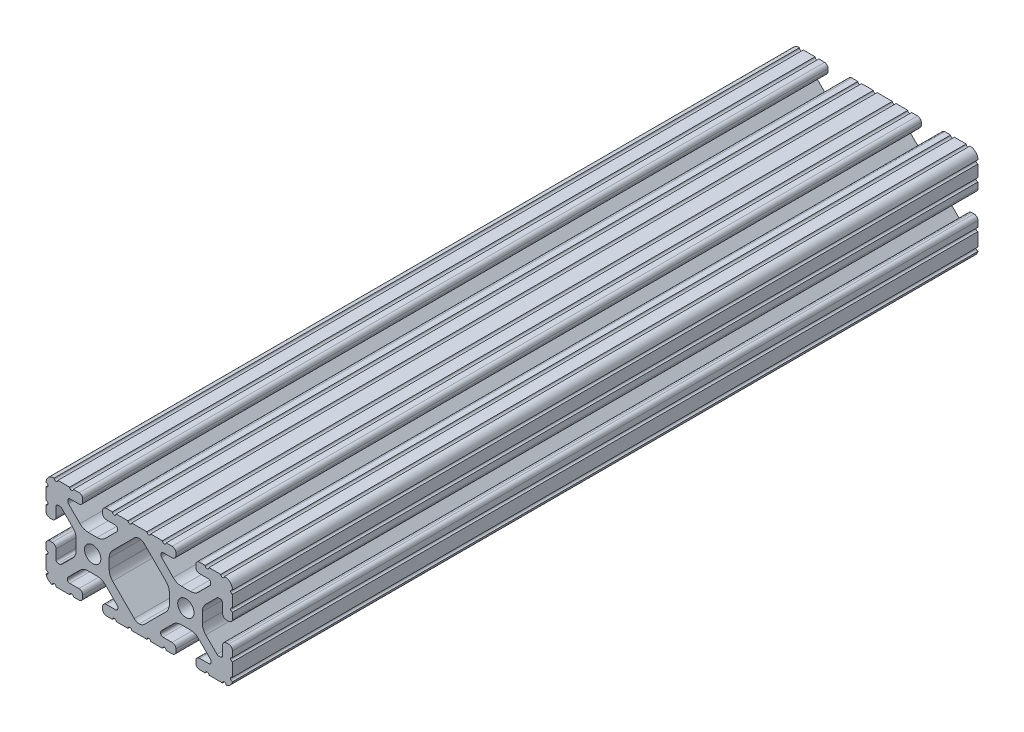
from build123d import *

# Parameters (mm, degrees)
SKETCH1_R      = 3.3274
EXTRUDE1_DEPTH = 304.8


with BuildPart() as part:
    # Sketch1 → Extrude1 (new body)
    with BuildSketch(Plane.XY):
        with BuildLine():
            Line((-3.121121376, -19.05), (3.121121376, -19.05))
            ThreePointArc((3.121121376, -19.05), (3.883121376, -18.288), (4.645121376, -19.05))
            Line((4.645121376, -19.05), (8.633115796, -19.05))
            Line((8.633115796, -19.05), (9.473536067, -19.05))
            ThreePointArc((9.473536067, -19.05), (10.235536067, -18.288), (10.997536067, -19.05))
            Line((10.997536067, -19.05), (13.4112, -19.05))
            ThreePointArc((13.4112, -19.05), (14.524751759, -18.588751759), (14.986, -17.4752))
            Line((14.986, -17.4752), (14.986, -16.5608))
            ThreePointArc((14.986, -16.5608), (14.524751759, -15.447248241), (13.4112, -14.986))
            Line((13.4112, -14.986), (9.652, -14.986))
            ThreePointArc((9.652, -14.986), (9.023382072, -14.725617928), (8.763, -14.097))
            Line((8.763, -14.097), (8.763, -13.687179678))
            ThreePointArc((8.763, -13.687179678), (8.830670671, -13.346975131), (9.023380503, -13.058563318))
            Line((9.023380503, -13.058563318), (13.852498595, -8.229421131))
            ThreePointArc((13.852498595, -8.229421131), (15.393447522, -7.199787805), (17.211122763, -6.838228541))
            Line((17.211122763, -6.838228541), (20.888877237, -6.838228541))
            ThreePointArc((20.888877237, -6.838228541), (22.706552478, -7.199787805), (24.247501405, -8.229421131))
            Line((24.247501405, -8.229421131), (29.076619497, -13.058563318))
            ThreePointArc((29.076619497, -13.058563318), (29.269329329, -13.346975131), (29.337, -13.687179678))
            Line((29.337, -13.687179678), (29.337, -14.097))
            ThreePointArc((29.337, -14.097), (29.076617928, -14.725617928), (28.448, -14.986))
            Line((28.448, -14.986), (24.6888, -14.986))
            ThreePointArc((24.6888, -14.986), (23.575248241, -15.447248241), (23.114, -16.5608))
            Line((23.114, -16.5608), (23.114, -17.4752))
            ThreePointArc((23.114, -17.4752), (23.575248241, -18.588751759), (24.6888, -19.05))
            Line((24.6888, -19.05), (26.945817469, -19.05))
            ThreePointArc((26.945817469, -19.05), (27.707817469, -18.288), (28.469817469, -19.05))
            Line((28.469817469, -19.05), (29.207115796, -19.05))
            Line((29.207115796, -19.05), (34.047273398, -19.05))
            ThreePointArc((34.047273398, -19.05), (34.809273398, -18.288), (35.571273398, -19.05))
            ThreePointArc((35.571273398, -19.05), (37.207577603, -18.182738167), (38.1, -16.560019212))
            ThreePointArc((38.1, -16.560019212), (37.338, -15.798019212), (38.1, -15.036019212))
            Line((38.1, -15.036019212), (38.1, -10.287))
            Line((38.1, -10.287), (38.1, -9.549701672))
            ThreePointArc((38.1, -9.549701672), (37.338, -8.787701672), (38.1, -8.025701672))
            Line((38.1, -8.025701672), (38.1, -5.6388))
            ThreePointArc((38.1, -5.6388), (37.638751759, -4.525248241), (36.5252, -4.064))
            Line((36.5252, -4.064), (35.6108, -4.064))
            ThreePointArc((35.6108, -4.064), (34.497248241, -4.525248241), (34.036, -5.6388))
            Line((34.036, -5.6388), (34.036, -9.398))
            ThreePointArc((34.036, -9.398), (33.775617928, -10.026617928), (33.147, -10.287))
            Line((33.147, -10.287), (32.420656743, -10.287))
            ThreePointArc((32.420656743, -10.287), (32.080450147, -10.21932848), (31.792037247, -10.02661636))
            Line((31.792037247, -10.02661636), (27.197575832, -5.43213202))
            ThreePointArc((27.197575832, -5.43213202), (26.167954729, -3.891188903), (25.8064, -2.07352461))
            Line((25.8064, -2.07352461), (25.8064, 2.07352461))
            ThreePointArc((25.8064, 2.07352461), (26.167954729, 3.891188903), (27.197575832, 5.43213202))
            Line((27.197575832, 5.43213202), (31.792037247, 10.02661636))
            ThreePointArc((31.792037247, 10.02661636), (32.080450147, 10.21932848), (32.420656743, 10.287))
            Line((32.420656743, 10.287), (33.147, 10.287))
            ThreePointArc((33.147, 10.287), (33.775617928, 10.026617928), (34.036, 9.398))
            Line((34.036, 9.398), (34.036, 5.6388))
            ThreePointArc((34.036, 5.6388), (34.497248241, 4.525248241), (35.6108, 4.064))
            Line((35.6108, 4.064), (36.5252, 4.064))
            ThreePointArc((36.5252, 4.064), (37.638751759, 4.525248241), (38.1, 5.6388))
            Line((38.1, 5.6388), (38.1, 8.025701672))
            ThreePointArc((38.1, 8.025701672), (37.338, 8.787701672), (38.1, 9.549701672))
            Line((38.1, 9.549701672), (38.1, 10.287))
            Line((38.1, 10.287), (38.1, 14.375206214))
            ThreePointArc((38.1, 14.375206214), (37.338232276, 15.156019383), (38.137614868, 15.89827725))
            ThreePointArc((38.137614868, 15.89827725), (37.148019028, 18.192014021), (34.819536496, 19.096833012))
            ThreePointArc((34.819536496, 19.096833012), (34.081312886, 18.311776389), (33.296256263, 19.05))
            Line((33.296256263, 19.05), (29.207115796, 19.05))
            Line((29.207115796, 19.05), (28.469817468, 19.05))
            ThreePointArc((28.469817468, 19.05), (27.707817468, 18.288), (26.945817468, 19.05))
            Line((26.945817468, 19.05), (24.558915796, 19.05))
            ThreePointArc((24.558915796, 19.05), (23.53023695, 18.547208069), (23.114, 17.480565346))
            Line((23.114, 17.480565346), (23.114, 16.5608))
            ThreePointArc((23.114, 16.5608), (23.575248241, 15.447248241), (24.6888, 14.986))
            Line((24.6888, 14.986), (28.295243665, 14.986))
            ThreePointArc((28.295243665, 14.986), (28.923861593, 14.725617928), (29.184243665, 14.097))
            Line((29.184243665, 14.097), (29.184243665, 13.53442258))
            ThreePointArc((29.184243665, 13.53442258), (29.116572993, 13.194218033), (28.923863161, 12.90580622))
            Line((28.923863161, 12.90580622), (24.247501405, 8.229421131))
            ThreePointArc((24.247501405, 8.229421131), (22.706552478, 7.199787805), (20.888877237, 6.838228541))
            Line((20.888877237, 6.838228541), (17.211122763, 6.838228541))
            ThreePointArc((17.211122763, 6.838228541), (15.393447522, 7.199787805), (13.852498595, 8.229421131))
            Line((13.852498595, 8.229421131), (9.176136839, 12.90580622))
            ThreePointArc((9.176136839, 12.90580622), (8.983427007, 13.194218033), (8.915756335, 13.53442258))
            Line((8.915756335, 13.53442258), (8.915756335, 14.097))
            ThreePointArc((8.915756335, 14.097), (9.176138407, 14.725617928), (9.804756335, 14.986))
            Line((9.804756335, 14.986), (13.4112, 14.986))
            ThreePointArc((13.4112, 14.986), (14.524751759, 15.447248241), (14.986, 16.5608))
            Line((14.986, 16.5608), (14.986, 17.496772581))
            ThreePointArc((14.986, 17.496772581), (14.531070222, 18.595070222), (13.432772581, 19.05))
            Line((13.432772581, 19.05), (10.997536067, 19.05))
            ThreePointArc((10.997536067, 19.05), (10.235536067, 18.288), (9.473536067, 19.05))
            Line((9.473536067, 19.05), (8.633115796, 19.05))
            Line((8.633115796, 19.05), (4.645121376, 19.05))
            ThreePointArc((4.645121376, 19.05), (3.883121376, 18.288), (3.121121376, 19.05))
            Line((3.121121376, 19.05), (-3.121121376, 19.05))
            ThreePointArc((-3.121121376, 19.05), (-3.883121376, 18.288), (-4.645121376, 19.05))
            Line((-4.645121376, 19.05), (-8.633115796, 19.05))
            Line((-8.633115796, 19.05), (-9.473536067, 19.05))
            ThreePointArc((-9.473536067, 19.05), (-10.235536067, 18.288), (-10.997536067, 19.05))
            Line((-10.997536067, 19.05), (-13.432772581, 19.05))
            ThreePointArc((-13.432772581, 19.05), (-14.531070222, 18.595070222), (-14.986, 17.496772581))
            Line((-14.986, 17.496772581), (-14.986, 16.5608))
            ThreePointArc((-14.986, 16.5608), (-14.524751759, 15.447248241), (-13.4112, 14.986))
            Line((-13.4112, 14.986), (-9.804756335, 14.986))
            ThreePointArc((-9.804756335, 14.986), (-9.176138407, 14.725617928), (-8.915756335, 14.097))
            Line((-8.915756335, 14.097), (-8.915756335, 13.53442258))
            ThreePointArc((-8.915756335, 13.53442258), (-8.983427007, 13.194218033), (-9.176136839, 12.90580622))
            Line((-9.176136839, 12.90580622), (-13.852498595, 8.229421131))
            ThreePointArc((-13.852498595, 8.229421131), (-15.393447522, 7.199787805), (-17.211122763, 6.838228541))
            Line((-17.211122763, 6.838228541), (-20.888877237, 6.838228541))
            ThreePointArc((-20.888877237, 6.838228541), (-22.706552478, 7.199787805), (-24.247501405, 8.229421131))
            Line((-24.247501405, 8.229421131), (-28.923863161, 12.90580622))
            ThreePointArc((-28.923863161, 12.90580622), (-29.116572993, 13.194218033), (-29.184243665, 13.53442258))
            Line((-29.184243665, 13.53442258), (-29.184243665, 14.097))
            ThreePointArc((-29.184243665, 14.097), (-28.923861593, 14.725617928), (-28.295243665, 14.986))
            Line((-28.295243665, 14.986), (-24.6888, 14.986))
            ThreePointArc((-24.6888, 14.986), (-23.575248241, 15.447248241), (-23.114, 16.5608))
            Line((-23.114, 16.5608), (-23.114, 17.480565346))
            ThreePointArc((-23.114, 17.480565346), (-23.53023695, 18.547208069), (-24.558915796, 19.05))
            Line((-24.558915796, 19.05), (-26.945817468, 19.05))
            ThreePointArc((-26.945817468, 19.05), (-27.707817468, 18.288), (-28.469817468, 19.05))
            Line((-28.469817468, 19.05), (-29.207115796, 19.05))
            Line((-29.207115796, 19.05), (-33.296256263, 19.05))
            ThreePointArc((-33.296256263, 19.05), (-34.081312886, 18.311776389), (-34.819536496, 19.096833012))
            ThreePointArc((-34.819536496, 19.096833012), (-37.148019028, 18.192014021), (-38.137614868, 15.89827725))
            ThreePointArc((-38.137614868, 15.89827725), (-37.338232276, 15.156019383), (-38.1, 14.375206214))
            Line((-38.1, 14.375206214), (-38.1, 10.287))
            Line((-38.1, 10.287), (-38.1, 9.549701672))
            ThreePointArc((-38.1, 9.549701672), (-37.338, 8.787701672), (-38.1, 8.025701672))
            Line((-38.1, 8.025701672), (-38.1, 5.6388))
            ThreePointArc((-38.1, 5.6388), (-37.638751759, 4.525248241), (-36.5252, 4.064))
            Line((-36.5252, 4.064), (-35.6108, 4.064))
            ThreePointArc((-35.6108, 4.064), (-34.497248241, 4.525248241), (-34.036, 5.6388))
            Line((-34.036, 5.6388), (-34.036, 9.398))
            ThreePointArc((-34.036, 9.398), (-33.775617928, 10.026617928), (-33.147, 10.287))
            Line((-33.147, 10.287), (-32.420656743, 10.287))
            ThreePointArc((-32.420656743, 10.287), (-32.080450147, 10.21932848), (-31.792037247, 10.02661636))
            Line((-31.792037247, 10.02661636), (-27.197575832, 5.43213202))
            ThreePointArc((-27.197575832, 5.43213202), (-26.167954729, 3.891188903), (-25.8064, 2.07352461))
            Line((-25.8064, 2.07352461), (-25.8064, -2.07352461))
            ThreePointArc((-25.8064, -2.07352461), (-26.167954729, -3.891188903), (-27.197575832, -5.43213202))
            Line((-27.197575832, -5.43213202), (-31.792037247, -10.02661636))
            ThreePointArc((-31.792037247, -10.02661636), (-32.080450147, -10.21932848), (-32.420656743, -10.287))
            Line((-32.420656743, -10.287), (-33.147, -10.287))
            ThreePointArc((-33.147, -10.287), (-33.775617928, -10.026617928), (-34.036, -9.398))
            Line((-34.036, -9.398), (-34.036, -5.6388))
            ThreePointArc((-34.036, -5.6388), (-34.497248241, -4.525248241), (-35.6108, -4.064))
            Line((-35.6108, -4.064), (-36.5252, -4.064))
            ThreePointArc((-36.5252, -4.064), (-37.638751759, -4.525248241), (-38.1, -5.6388))
            Line((-38.1, -5.6388), (-38.1, -8.025701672))
            ThreePointArc((-38.1, -8.025701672), (-37.338, -8.787701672), (-38.1, -9.549701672))
            Line((-38.1, -9.549701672), (-38.1, -10.287))
            Line((-38.1, -10.287), (-38.1, -15.036019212))
            ThreePointArc((-38.1, -15.036019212), (-37.338, -15.798019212), (-38.1, -16.560019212))
            ThreePointArc((-38.1, -16.560019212), (-37.20882252, -18.184002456), (-35.571273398, -19.05))
            ThreePointArc((-35.571273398, -19.05), (-34.809273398, -18.288), (-34.047273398, -19.05))
            Line((-34.047273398, -19.05), (-29.207115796, -19.05))
            Line((-29.207115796, -19.05), (-28.469817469, -19.05))
            ThreePointArc((-28.469817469, -19.05), (-27.707817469, -18.288), (-26.945817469, -19.05))
            Line((-26.945817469, -19.05), (-24.6888, -19.05))
            ThreePointArc((-24.6888, -19.05), (-23.575248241, -18.588751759), (-23.114, -17.4752))
            Line((-23.114, -17.4752), (-23.114, -16.5608))
            ThreePointArc((-23.114, -16.5608), (-23.575248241, -15.447248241), (-24.6888, -14.986))
            Line((-24.6888, -14.986), (-28.448, -14.986))
            ThreePointArc((-28.448, -14.986), (-29.076617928, -14.725617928), (-29.337, -14.097))
            Line((-29.337, -14.097), (-29.337, -13.687179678))
            ThreePointArc((-29.337, -13.687179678), (-29.269329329, -13.346975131), (-29.076619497, -13.058563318))
            Line((-29.076619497, -13.058563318), (-24.247501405, -8.229421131))
            ThreePointArc((-24.247501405, -8.229421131), (-22.706552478, -7.199787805), (-20.888877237, -6.838228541))
            Line((-20.888877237, -6.838228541), (-17.211122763, -6.838228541))
            ThreePointArc((-17.211122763, -6.838228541), (-15.393447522, -7.199787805), (-13.852498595, -8.229421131))
            Line((-13.852498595, -8.229421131), (-9.023380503, -13.058563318))
            ThreePointArc((-9.023380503, -13.058563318), (-8.830670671, -13.346975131), (-8.763, -13.687179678))
            Line((-8.763, -13.687179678), (-8.763, -14.097))
            ThreePointArc((-8.763, -14.097), (-9.023382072, -14.725617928), (-9.652, -14.986))
            Line((-9.652, -14.986), (-13.4112, -14.986))
            ThreePointArc((-13.4112, -14.986), (-14.524751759, -15.447248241), (-14.986, -16.5608))
            Line((-14.986, -16.5608), (-14.986, -17.4752))
            ThreePointArc((-14.986, -17.4752), (-14.524751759, -18.588751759), (-13.4112, -19.05))
            Line((-13.4112, -19.05), (-10.997536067, -19.05))
            ThreePointArc((-10.997536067, -19.05), (-10.235536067, -18.288), (-9.473536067, -19.05))
            Line((-9.473536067, -19.05), (-8.633115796, -19.05))
            Line((-8.633115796, -19.05), (-4.645121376, -19.05))
            ThreePointArc((-4.645121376, -19.05), (-3.883121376, -18.288), (-3.121121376, -19.05))
        make_face()
        with Locations((19.05, 0)):
            Circle(SKETCH1_R, mode=Mode.SUBTRACT)
        with Locations((-19.05, 0)):
            Circle(SKETCH1_R, mode=Mode.SUBTRACT)
        with BuildLine():
            Line((2.077035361, 14.257564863), (10.902424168, 5.43213202))
            ThreePointArc((10.902424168, 5.43213202), (11.932045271, 3.891188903), (12.2936, 2.07352461))
            Line((12.2936, 2.07352461), (12.2936, -2.07352461))
            ThreePointArc((12.2936, -2.07352461), (11.932045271, -3.891188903), (10.902424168, -5.43213202))
            Line((10.902424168, -5.43213202), (2.077035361, -14.257564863))
            ThreePointArc((2.077035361, -14.257564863), (1.124045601, -14.892973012), (0, -15.113096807))
            ThreePointArc((0, -15.113096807), (-1.124045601, -14.892973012), (-2.077035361, -14.257564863))
            Line((-2.077035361, -14.257564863), (-10.902424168, -5.43213202))
            ThreePointArc((-10.902424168, -5.43213202), (-11.932045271, -3.891188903), (-12.2936, -2.07352461))
            Line((-12.2936, -2.07352461), (-12.2936, 2.07352461))
            ThreePointArc((-12.2936, 2.07352461), (-11.932045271, 3.891188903), (-10.902424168, 5.43213202))
            Line((-10.902424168, 5.43213202), (-2.077035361, 14.257564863))
            ThreePointArc((-2.077035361, 14.257564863), (-1.124045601, 14.892973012), (0, 15.113096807))
            ThreePointArc((0, 15.113096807), (1.124045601, 14.892973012), (2.077035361, 14.257564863))
        make_face(mode=Mode.SUBTRACT)
    extrude(amount=-EXTRUDE1_DEPTH)


solid = part.part
